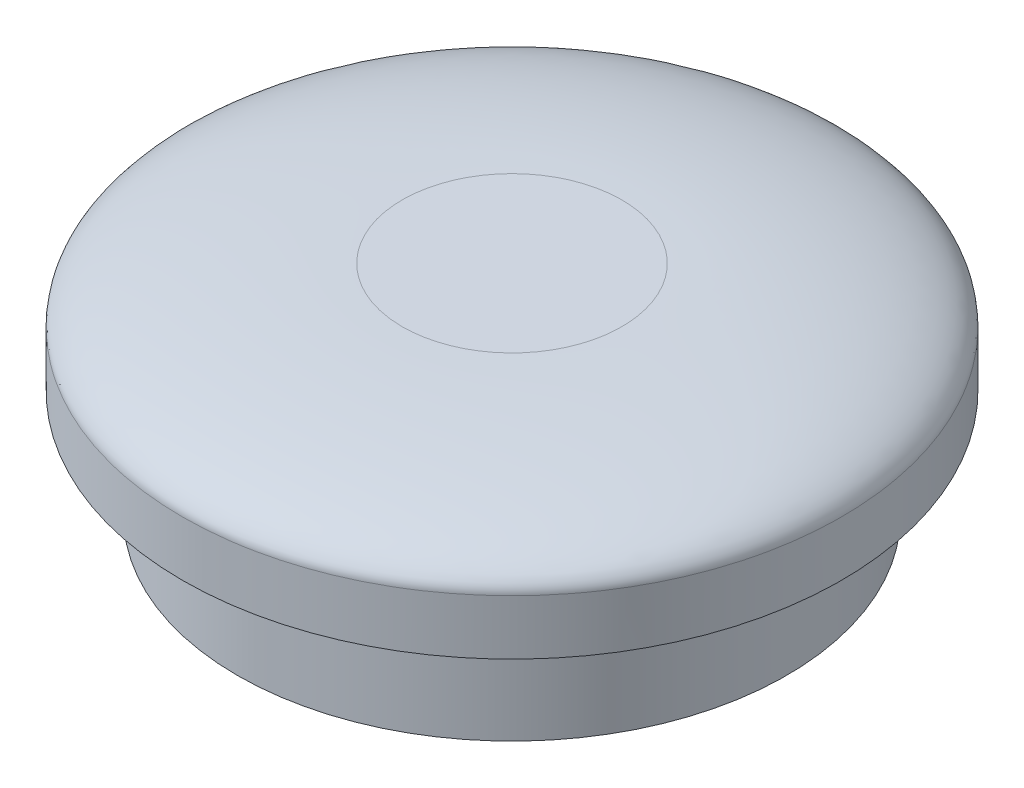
ISO-10303-21;
HEADER;
FILE_DESCRIPTION(('STEP AP214'),'2;1');
FILE_NAME('part.step','',(''),(''),'','','');
FILE_SCHEMA(('AUTOMOTIVE_DESIGN { 1 0 10303 214 1 1 1 1 }'));
ENDSEC;
DATA;
#1=APPLICATION_CONTEXT('core data for automotive mechanical design processes');
#2=APPLICATION_PROTOCOL_DEFINITION('international standard','automotive_design',2000,#1);
#3=PRODUCT_CONTEXT('',#1,'mechanical');
#4=PRODUCT('Part','Part','',(#3));
#5=PRODUCT_RELATED_PRODUCT_CATEGORY('part','',(#4));
#6=PRODUCT_DEFINITION_FORMATION('','',#4);
#7=PRODUCT_DEFINITION_CONTEXT('part definition',#1,'design');
#8=PRODUCT_DEFINITION('design','',#6,#7);
#9=PRODUCT_DEFINITION_SHAPE('','',#8);
#10=(LENGTH_UNIT() NAMED_UNIT(*) SI_UNIT(.MILLI.,.METRE.));
#11=(NAMED_UNIT(*) PLANE_ANGLE_UNIT() SI_UNIT($,.RADIAN.));
#12=(NAMED_UNIT(*) SI_UNIT($,.STERADIAN.) SOLID_ANGLE_UNIT());
#13=UNCERTAINTY_MEASURE_WITH_UNIT(LENGTH_MEASURE(1.E-05),#10,'distance_accuracy_value','');
#14=(GEOMETRIC_REPRESENTATION_CONTEXT(3) GLOBAL_UNCERTAINTY_ASSIGNED_CONTEXT((#13)) GLOBAL_UNIT_ASSIGNED_CONTEXT((#10,
#11,#12)) REPRESENTATION_CONTEXT('',''));
#15=CARTESIAN_POINT('',(0.,0.,0.));
#16=DIRECTION('',(0.,0.,1.));
#17=DIRECTION('',(1.,0.,0.));
#18=AXIS2_PLACEMENT_3D('',#15,#16,#17);
#19=CARTESIAN_POINT('',(0.,10.,0.));
#20=DIRECTION('',(0.,-1.,0.));
#21=DIRECTION('',(0.,0.,-1.));
#22=AXIS2_PLACEMENT_3D('',#19,#20,#21);
#23=CYLINDRICAL_SURFACE('',#22,25.);
#24=CARTESIAN_POINT('',(0.,10.,0.));
#25=DIRECTION('',(0.,1.,0.));
#26=DIRECTION('',(0.,0.,1.));
#27=AXIS2_PLACEMENT_3D('',#24,#25,#26);
#28=CIRCLE('',#27,25.);
#29=CARTESIAN_POINT('',(0.,10.,25.));
#30=VERTEX_POINT('',#29);
#31=EDGE_CURVE('E68',#30,#30,#28,.T.);
#32=ORIENTED_EDGE('',*,*,#31,.F.);
#33=EDGE_LOOP('',(#32));
#34=FACE_BOUND('',#33,.T.);
#35=CARTESIAN_POINT('',(0.,0.,0.));
#36=DIRECTION('',(0.,1.,0.));
#37=DIRECTION('',(0.,0.,1.));
#38=AXIS2_PLACEMENT_3D('',#35,#36,#37);
#39=CIRCLE('',#38,25.);
#40=CARTESIAN_POINT('',(0.,0.,25.));
#41=VERTEX_POINT('',#40);
#42=EDGE_CURVE('E74',#41,#41,#39,.T.);
#43=ORIENTED_EDGE('',*,*,#42,.T.);
#44=EDGE_LOOP('',(#43));
#45=FACE_BOUND('',#44,.T.);
#46=ADVANCED_FACE('F48',(#34,#45),#23,.T.);
#47=CARTESIAN_POINT('',(0.,0.,0.));
#48=DIRECTION('',(0.,1.,0.));
#49=DIRECTION('',(0.,0.,1.));
#50=AXIS2_PLACEMENT_3D('',#47,#48,#49);
#51=PLANE('',#50);
#52=ORIENTED_EDGE('',*,*,#42,.F.);
#53=EDGE_LOOP('',(#52));
#54=FACE_BOUND('',#53,.T.);
#55=ADVANCED_FACE('F104',(#54),#51,.F.);
#56=CARTESIAN_POINT('',(0.,20.,0.));
#57=DIRECTION('',(0.,-1.,0.));
#58=DIRECTION('',(0.,0.,-1.));
#59=AXIS2_PLACEMENT_3D('',#56,#57,#58);
#60=CYLINDRICAL_SURFACE('',#59,30.);
#61=CARTESIAN_POINT('',(0.,15.,30.));
#62=CARTESIAN_POINT('',(3.92699081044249,15.,30.));
#63=CARTESIAN_POINT('',(7.85243653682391,15.,29.2191802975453));
#64=CARTESIAN_POINT('',(15.1085694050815,15.,26.2135916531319));
#65=CARTESIAN_POINT('',(18.4364016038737,15.,23.9900052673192));
#66=CARTESIAN_POINT('',(23.9900052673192,15.,18.4364016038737));
#67=CARTESIAN_POINT('',(26.2135916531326,15.,15.1085694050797));
#68=CARTESIAN_POINT('',(29.2191802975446,15.,7.85243653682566));
#69=CARTESIAN_POINT('',(30.,15.,3.92699081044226));
#70=CARTESIAN_POINT('',(30.,15.,-3.92699081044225));
#71=CARTESIAN_POINT('',(29.2191802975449,15.,-7.85243653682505));
#72=CARTESIAN_POINT('',(26.2135916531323,15.,-15.1085694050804));
#73=CARTESIAN_POINT('',(23.9900052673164,15.,-18.4364016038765));
#74=CARTESIAN_POINT('',(18.4364016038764,15.,-23.9900052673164));
#75=CARTESIAN_POINT('',(15.1085694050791,15.,-26.2135916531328));
#76=CARTESIAN_POINT('',(7.85243653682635,15.,-29.2191802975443));
#77=CARTESIAN_POINT('',(3.92699081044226,15.,-30.));
#78=CARTESIAN_POINT('',(-3.92699081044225,15.,-30.));
#79=CARTESIAN_POINT('',(-7.85243653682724,15.,-29.219180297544));
#80=CARTESIAN_POINT('',(-15.1085694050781,15.,-26.2135916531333));
#81=CARTESIAN_POINT('',(-18.436401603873,15.,-23.9900052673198));
#82=CARTESIAN_POINT('',(-23.9900052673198,15.,-18.436401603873));
#83=CARTESIAN_POINT('',(-26.2135916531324,15.,-15.1085694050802));
#84=CARTESIAN_POINT('',(-29.2191802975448,15.,-7.85243653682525));
#85=CARTESIAN_POINT('',(-30.,15.,-3.92699081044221));
#86=CARTESIAN_POINT('',(-30.,15.,3.92699081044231));
#87=CARTESIAN_POINT('',(-29.2191802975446,15.,7.85243653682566));
#88=CARTESIAN_POINT('',(-26.2135916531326,15.,15.1085694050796));
#89=CARTESIAN_POINT('',(-23.9900052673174,15.,18.4364016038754));
#90=CARTESIAN_POINT('',(-18.4364016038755,15.,23.9900052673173));
#91=CARTESIAN_POINT('',(-15.1085694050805,15.,26.2135916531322));
#92=CARTESIAN_POINT('',(-7.85243653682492,15.,29.2191802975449));
#93=CARTESIAN_POINT('',(-3.92699081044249,15.,30.));
#94=CARTESIAN_POINT('',(0.,15.,30.));
#95=(BOUNDED_CURVE() B_SPLINE_CURVE(3,(#61,#62,#63,#64,#65,#66,#67,#68,#69,#70,#71,#72,#73,#74,
#75,#76,#77,#78,#79,#80,#81,#82,#83,#84,#85,#86,#87,#88,#89,#90,#91,#92,#93,#94),.UNSPECIFIED.,
.T.,.F.) B_SPLINE_CURVE_WITH_KNOTS((4,2,2,2,2,2,2,2,2,2,2,2,2,2,2,2,4),(0.,0.392699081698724,
0.785398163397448,1.17809724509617,1.5707963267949,1.96349540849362,2.35619449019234,
2.74889357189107,3.14159265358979,3.53429173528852,3.92699081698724,4.31968989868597,
4.71238898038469,5.10508806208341,5.49778714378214,5.89048622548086,6.28318530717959),
.UNSPECIFIED.) CURVE() GEOMETRIC_REPRESENTATION_ITEM() RATIONAL_B_SPLINE_CURVE((1.,1.,1.,1.,1.,
1.,1.,1.,1.,1.,1.,1.,1.,1.,1.,1.,1.,1.,1.,1.,1.,1.,1.,1.,1.,1.,1.,1.,1.,1.,1.,1.,1.,1.)) REPRESENTATION_ITEM(''));
#96=CARTESIAN_POINT('',(0.,15.,30.));
#97=VERTEX_POINT('',#96);
#98=EDGE_CURVE('E11',#97,#97,#95,.F.);
#99=ORIENTED_EDGE('',*,*,#98,.T.);
#100=EDGE_LOOP('',(#99));
#101=FACE_BOUND('',#100,.T.);
#102=CARTESIAN_POINT('',(0.,10.,0.));
#103=DIRECTION('',(0.,1.,0.));
#104=DIRECTION('',(0.,0.,1.));
#105=AXIS2_PLACEMENT_3D('',#102,#103,#104);
#106=CIRCLE('',#105,30.);
#107=CARTESIAN_POINT('',(0.,10.,30.));
#108=VERTEX_POINT('',#107);
#109=EDGE_CURVE('E80',#108,#108,#106,.T.);
#110=ORIENTED_EDGE('',*,*,#109,.T.);
#111=EDGE_LOOP('',(#110));
#112=FACE_BOUND('',#111,.T.);
#113=ADVANCED_FACE('F98',(#101,#112),#60,.T.);
#114=CARTESIAN_POINT('',(0.,20.,0.));
#115=DIRECTION('',(0.,1.,0.));
#116=DIRECTION('',(0.,0.,1.));
#117=AXIS2_PLACEMENT_3D('',#114,#115,#116);
#118=PLANE('',#117);
#119=CARTESIAN_POINT('',(0.,20.,10.));
#120=CARTESIAN_POINT('',(-1.30899693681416,20.,10.));
#121=CARTESIAN_POINT('',(-2.61747884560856,20.,9.73972676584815));
#122=CARTESIAN_POINT('',(-5.03618980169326,20.,8.73786388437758));
#123=CARTESIAN_POINT('',(-6.14546720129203,20.,7.99666842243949));
#124=CARTESIAN_POINT('',(-7.99666842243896,20.,6.14546720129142));
#125=CARTESIAN_POINT('',(-8.73786388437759,20.,5.03618980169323));
#126=CARTESIAN_POINT('',(-9.73972676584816,20.,2.61747884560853));
#127=CARTESIAN_POINT('',(-10.,20.,1.3089969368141));
#128=CARTESIAN_POINT('',(-10.,20.,-1.30899693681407));
#129=CARTESIAN_POINT('',(-9.73972676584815,20.,-2.61747884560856));
#130=CARTESIAN_POINT('',(-8.73786388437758,20.,-5.03618980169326));
#131=CARTESIAN_POINT('',(-7.99666842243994,20.,-6.14546720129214));
#132=CARTESIAN_POINT('',(-6.14546720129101,20.,-7.9966684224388));
#133=CARTESIAN_POINT('',(-5.03618980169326,20.,-8.73786388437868));
#134=CARTESIAN_POINT('',(-2.61747884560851,20.,-9.73972676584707));
#135=CARTESIAN_POINT('',(-1.30899693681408,20.,-10.));
#136=CARTESIAN_POINT('',(1.30899693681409,20.,-10.));
#137=CARTESIAN_POINT('',(2.61747884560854,20.,-9.73972676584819));
#138=CARTESIAN_POINT('',(5.03618980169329,20.,-8.73786388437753));
#139=CARTESIAN_POINT('',(6.14546720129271,20.,-7.99666842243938));
#140=CARTESIAN_POINT('',(7.99666842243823,20.,-6.14546720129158));
#141=CARTESIAN_POINT('',(8.73786388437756,20.,-5.03618980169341));
#142=CARTESIAN_POINT('',(9.73972676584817,20.,-2.6174788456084));
#143=CARTESIAN_POINT('',(10.,20.,-1.30899693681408));
#144=CARTESIAN_POINT('',(10.,20.,1.30899693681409));
#145=CARTESIAN_POINT('',(9.73972676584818,20.,2.61747884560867));
#146=CARTESIAN_POINT('',(8.73786388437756,20.,5.03618980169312));
#147=CARTESIAN_POINT('',(7.99666842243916,20.,6.14546720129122));
#148=CARTESIAN_POINT('',(6.14546720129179,20.,7.99666842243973));
#149=CARTESIAN_POINT('',(5.0361898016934,20.,8.73786388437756));
#150=CARTESIAN_POINT('',(2.61747884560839,20.,9.73972676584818));
#151=CARTESIAN_POINT('',(1.30899693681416,20.,10.));
#152=CARTESIAN_POINT('',(0.,20.,10.));
#153=(BOUNDED_CURVE() B_SPLINE_CURVE(3,(#119,#120,#121,#122,#123,#124,#125,#126,#127,#128,#129,
#130,#131,#132,#133,#134,#135,#136,#137,#138,#139,#140,#141,#142,#143,#144,#145,#146,#147,#148,
#149,#150,#151,#152),.UNSPECIFIED.,.T.,.F.) B_SPLINE_CURVE_WITH_KNOTS((4,2,2,2,2,2,2,2,2,2,2,2,
2,2,2,2,4),(0.,0.392699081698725,0.785398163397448,1.17809724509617,1.5707963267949,
1.96349540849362,2.35619449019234,2.74889357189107,3.14159265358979,3.53429173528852,
3.92699081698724,4.31968989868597,4.71238898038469,5.10508806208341,5.49778714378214,
5.89048622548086,6.28318530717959),
.UNSPECIFIED.) CURVE() GEOMETRIC_REPRESENTATION_ITEM() RATIONAL_B_SPLINE_CURVE((1.,1.,1.,1.,1.,
1.,1.,1.,1.,1.,1.,1.,1.,1.,1.,1.,1.,1.,1.,1.,1.,1.,1.,1.,1.,1.,1.,1.,1.,1.,1.,1.,1.,1.)) REPRESENTATION_ITEM(''));
#154=CARTESIAN_POINT('',(0.,20.,10.));
#155=VERTEX_POINT('',#154);
#156=EDGE_CURVE('E62',#155,#155,#153,.F.);
#157=ORIENTED_EDGE('',*,*,#156,.T.);
#158=EDGE_LOOP('',(#157));
#159=FACE_BOUND('',#158,.T.);
#160=ADVANCED_FACE('F88',(#159),#118,.T.);
#161=CARTESIAN_POINT('',(0.,10.,0.));
#162=DIRECTION('',(0.,1.,0.));
#163=DIRECTION('',(0.,0.,1.));
#164=AXIS2_PLACEMENT_3D('',#161,#162,#163);
#165=PLANE('',#164);
#166=ORIENTED_EDGE('',*,*,#31,.T.);
#167=EDGE_LOOP('',(#166));
#168=FACE_BOUND('',#167,.T.);
#169=ORIENTED_EDGE('',*,*,#109,.F.);
#170=EDGE_LOOP('',(#169));
#171=FACE_BOUND('',#170,.T.);
#172=ADVANCED_FACE('F97',(#168,#171),#165,.F.);
#173=CARTESIAN_POINT('',(0.,20.,10.));
#174=CARTESIAN_POINT('',(1.30899693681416,20.,10.));
#175=CARTESIAN_POINT('',(2.61747884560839,20.,9.73972676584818));
#176=CARTESIAN_POINT('',(5.0361898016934,20.,8.73786388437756));
#177=CARTESIAN_POINT('',(6.14546720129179,20.,7.99666842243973));
#178=CARTESIAN_POINT('',(7.99666842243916,20.,6.14546720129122));
#179=CARTESIAN_POINT('',(8.73786388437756,20.,5.03618980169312));
#180=CARTESIAN_POINT('',(9.73972676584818,20.,2.61747884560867));
#181=CARTESIAN_POINT('',(10.,20.,1.30899693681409));
#182=CARTESIAN_POINT('',(10.,20.,-1.30899693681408));
#183=CARTESIAN_POINT('',(9.73972676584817,20.,-2.6174788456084));
#184=CARTESIAN_POINT('',(8.73786388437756,20.,-5.03618980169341));
#185=CARTESIAN_POINT('',(7.99666842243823,20.,-6.14546720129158));
#186=CARTESIAN_POINT('',(6.14546720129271,20.,-7.99666842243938));
#187=CARTESIAN_POINT('',(5.03618980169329,20.,-8.73786388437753));
#188=CARTESIAN_POINT('',(2.61747884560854,20.,-9.73972676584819));
#189=CARTESIAN_POINT('',(1.30899693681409,20.,-10.));
#190=CARTESIAN_POINT('',(-1.30899693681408,20.,-10.));
#191=CARTESIAN_POINT('',(-2.61747884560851,20.,-9.73972676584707));
#192=CARTESIAN_POINT('',(-5.03618980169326,20.,-8.73786388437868));
#193=CARTESIAN_POINT('',(-6.14546720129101,20.,-7.9966684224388));
#194=CARTESIAN_POINT('',(-7.99666842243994,20.,-6.14546720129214));
#195=CARTESIAN_POINT('',(-8.73786388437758,20.,-5.03618980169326));
#196=CARTESIAN_POINT('',(-9.73972676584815,20.,-2.61747884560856));
#197=CARTESIAN_POINT('',(-10.,20.,-1.30899693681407));
#198=CARTESIAN_POINT('',(-10.,20.,1.3089969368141));
#199=CARTESIAN_POINT('',(-9.73972676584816,20.,2.61747884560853));
#200=CARTESIAN_POINT('',(-8.73786388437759,20.,5.03618980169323));
#201=CARTESIAN_POINT('',(-7.99666842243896,20.,6.14546720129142));
#202=CARTESIAN_POINT('',(-6.14546720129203,20.,7.99666842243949));
#203=CARTESIAN_POINT('',(-5.03618980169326,20.,8.73786388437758));
#204=CARTESIAN_POINT('',(-2.61747884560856,20.,9.73972676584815));
#205=CARTESIAN_POINT('',(-1.30899693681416,20.,10.));
#206=CARTESIAN_POINT('',(0.,20.,10.));
#207=CARTESIAN_POINT('',(0.,20.,30.));
#208=CARTESIAN_POINT('',(3.92699081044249,19.9999999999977,29.9999999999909));
#209=CARTESIAN_POINT('',(7.85243653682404,20.,29.2191802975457));
#210=CARTESIAN_POINT('',(15.1085694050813,20.,26.2135916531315));
#211=CARTESIAN_POINT('',(18.4364016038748,19.9999999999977,23.9900052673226));
#212=CARTESIAN_POINT('',(23.990005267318,20.0000000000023,18.4364016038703));
#213=CARTESIAN_POINT('',(26.2135916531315,20.,15.1085694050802));
#214=CARTESIAN_POINT('',(29.2191802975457,20.,7.85243653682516));
#215=CARTESIAN_POINT('',(30.,20.,3.92699081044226));
#216=CARTESIAN_POINT('',(30.,20.,-3.92699081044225));
#217=CARTESIAN_POINT('',(29.2191802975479,20.0000000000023,-7.85243653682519));
#218=CARTESIAN_POINT('',(26.2135916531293,19.9999999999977,-15.1085694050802));
#219=CARTESIAN_POINT('',(23.9900052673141,20.0000000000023,-18.4364016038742));
#220=CARTESIAN_POINT('',(18.4364016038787,19.9999999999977,-23.9900052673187));
#221=CARTESIAN_POINT('',(15.1085694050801,19.9999999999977,-26.2135916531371));
#222=CARTESIAN_POINT('',(7.85243653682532,20.0000000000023,-29.21918029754));
#223=CARTESIAN_POINT('',(3.92699081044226,20.,-30.));
#224=CARTESIAN_POINT('',(-3.92699081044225,20.,-30.));
#225=CARTESIAN_POINT('',(-7.85243653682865,20.,-29.2191802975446));
#226=CARTESIAN_POINT('',(-15.1085694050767,20.,-26.2135916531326));
#227=CARTESIAN_POINT('',(-18.4364016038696,20.0000000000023,-23.9900052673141));
#228=CARTESIAN_POINT('',(-23.9900052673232,19.9999999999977,-18.4364016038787));
#229=CARTESIAN_POINT('',(-26.2135916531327,20.,-15.1085694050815));
#230=CARTESIAN_POINT('',(-29.2191802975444,20.,-7.85243653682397));
#231=CARTESIAN_POINT('',(-30.,20.,-3.92699081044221));
#232=CARTESIAN_POINT('',(-30.,20.,3.92699081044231));
#233=CARTESIAN_POINT('',(-29.2191802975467,20.0000000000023,7.85243653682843));
#234=CARTESIAN_POINT('',(-26.2135916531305,19.9999999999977,15.1085694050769));
#235=CARTESIAN_POINT('',(-23.9900052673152,20.,18.4364016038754));
#236=CARTESIAN_POINT('',(-18.4364016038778,20.,23.9900052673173));
#237=CARTESIAN_POINT('',(-15.1085694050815,20.,26.2135916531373));
#238=CARTESIAN_POINT('',(-7.85243653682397,20.,29.2191802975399));
#239=CARTESIAN_POINT('',(-3.92699081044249,20.0000000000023,30.0000000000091));
#240=CARTESIAN_POINT('',(0.,20.,30.));
#241=CARTESIAN_POINT('',(0.,15.,30.));
#242=CARTESIAN_POINT('',(3.92699081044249,15.,30.));
#243=CARTESIAN_POINT('',(7.85243653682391,15.,29.2191802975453));
#244=CARTESIAN_POINT('',(15.1085694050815,15.,26.2135916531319));
#245=CARTESIAN_POINT('',(18.4364016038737,15.,23.9900052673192));
#246=CARTESIAN_POINT('',(23.9900052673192,15.,18.4364016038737));
#247=CARTESIAN_POINT('',(26.2135916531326,15.,15.1085694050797));
#248=CARTESIAN_POINT('',(29.2191802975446,15.,7.85243653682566));
#249=CARTESIAN_POINT('',(30.,15.,3.92699081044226));
#250=CARTESIAN_POINT('',(30.,15.,-3.92699081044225));
#251=CARTESIAN_POINT('',(29.2191802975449,15.,-7.85243653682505));
#252=CARTESIAN_POINT('',(26.2135916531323,15.,-15.1085694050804));
#253=CARTESIAN_POINT('',(23.9900052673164,15.,-18.4364016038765));
#254=CARTESIAN_POINT('',(18.4364016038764,15.,-23.9900052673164));
#255=CARTESIAN_POINT('',(15.1085694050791,15.,-26.2135916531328));
#256=CARTESIAN_POINT('',(7.85243653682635,15.,-29.2191802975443));
#257=CARTESIAN_POINT('',(3.92699081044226,15.,-30.));
#258=CARTESIAN_POINT('',(-3.92699081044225,15.,-30.));
#259=CARTESIAN_POINT('',(-7.85243653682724,15.,-29.219180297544));
#260=CARTESIAN_POINT('',(-15.1085694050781,15.,-26.2135916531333));
#261=CARTESIAN_POINT('',(-18.436401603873,15.,-23.9900052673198));
#262=CARTESIAN_POINT('',(-23.9900052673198,15.,-18.436401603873));
#263=CARTESIAN_POINT('',(-26.2135916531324,15.,-15.1085694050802));
#264=CARTESIAN_POINT('',(-29.2191802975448,15.,-7.85243653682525));
#265=CARTESIAN_POINT('',(-30.,15.,-3.92699081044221));
#266=CARTESIAN_POINT('',(-30.,15.,3.92699081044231));
#267=CARTESIAN_POINT('',(-29.2191802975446,15.,7.85243653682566));
#268=CARTESIAN_POINT('',(-26.2135916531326,15.,15.1085694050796));
#269=CARTESIAN_POINT('',(-23.9900052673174,15.,18.4364016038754));
#270=CARTESIAN_POINT('',(-18.4364016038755,15.,23.9900052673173));
#271=CARTESIAN_POINT('',(-15.1085694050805,15.,26.2135916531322));
#272=CARTESIAN_POINT('',(-7.85243653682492,15.,29.2191802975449));
#273=CARTESIAN_POINT('',(-3.92699081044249,15.,30.));
#274=CARTESIAN_POINT('',(0.,15.,30.));
#275=(BOUNDED_SURFACE() B_SPLINE_SURFACE(2,3,((#173,#174,#175,#176,#177,#178,#179,#180,#181,
#182,#183,#184,#185,#186,#187,#188,#189,#190,#191,#192,#193,#194,#195,#196,#197,#198,#199,#200,
#201,#202,#203,#204,#205,#206),(#207,#208,#209,#210,#211,#212,#213,#214,#215,#216,#217,#218,
#219,#220,#221,#222,#223,#224,#225,#226,#227,#228,#229,#230,#231,#232,#233,#234,#235,#236,#237,
#238,#239,#240),(#241,#242,#243,#244,#245,#246,#247,#248,#249,#250,#251,#252,#253,#254,#255,
#256,#257,#258,#259,#260,#261,#262,#263,#264,#265,#266,#267,#268,#269,#270,#271,#272,#273,
#274)),.UNSPECIFIED.,.F.,.T.,.F.) B_SPLINE_SURFACE_WITH_KNOTS((3,3),(4,2,2,2,2,2,2,2,2,2,2,2,2,
2,2,2,4),(0.,1.),(0.,0.392699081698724,0.785398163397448,1.17809724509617,1.5707963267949,
1.96349540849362,2.35619449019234,2.74889357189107,3.14159265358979,3.53429173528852,
3.92699081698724,4.31968989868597,4.71238898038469,5.10508806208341,5.49778714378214,
5.89048622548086,6.28318530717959),
.UNSPECIFIED.) GEOMETRIC_REPRESENTATION_ITEM() RATIONAL_B_SPLINE_SURFACE(((1.,1.,1.,1.,1.,1.,1.,
1.,1.,1.,1.,1.,1.,1.,1.,1.,1.,1.,1.,1.,1.,1.,1.,1.,1.,1.,1.,1.,1.,1.,1.,1.,1.,1.),
(0.707106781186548,0.707106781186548,0.707106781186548,0.707106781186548,0.707106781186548,
0.707106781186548,0.707106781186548,0.707106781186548,0.707106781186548,0.707106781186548,
0.707106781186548,0.707106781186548,0.707106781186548,0.707106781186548,0.707106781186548,
0.707106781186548,0.707106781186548,0.707106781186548,0.707106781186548,0.707106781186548,
0.707106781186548,0.707106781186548,0.707106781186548,0.707106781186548,0.707106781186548,
0.707106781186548,0.707106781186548,0.707106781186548,0.707106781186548,0.707106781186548,
0.707106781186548,0.707106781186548,0.707106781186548,0.707106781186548),(1.,1.,1.,1.,1.,1.,1.,
1.,1.,1.,1.,1.,1.,1.,1.,1.,1.,1.,1.,1.,1.,1.,1.,1.,1.,1.,1.,1.,1.,1.,1.,1.,1.,1.))) REPRESENTATION_ITEM('') SURFACE());
#276=ORIENTED_EDGE('',*,*,#98,.F.);
#277=EDGE_LOOP('',(#276));
#278=FACE_BOUND('',#277,.T.);
#279=ORIENTED_EDGE('',*,*,#156,.F.);
#280=EDGE_LOOP('',(#279));
#281=FACE_BOUND('',#280,.T.);
#282=ADVANCED_FACE('F51',(#278,#281),#275,.T.);
#283=CLOSED_SHELL('',(#46,#55,#113,#160,#172,#282));
#284=MANIFOLD_SOLID_BREP('B2',#283);
#285=ADVANCED_BREP_SHAPE_REPRESENTATION('',(#18,#284),#14);
#286=SHAPE_DEFINITION_REPRESENTATION(#9,#285);
ENDSEC;
END-ISO-10303-21;
